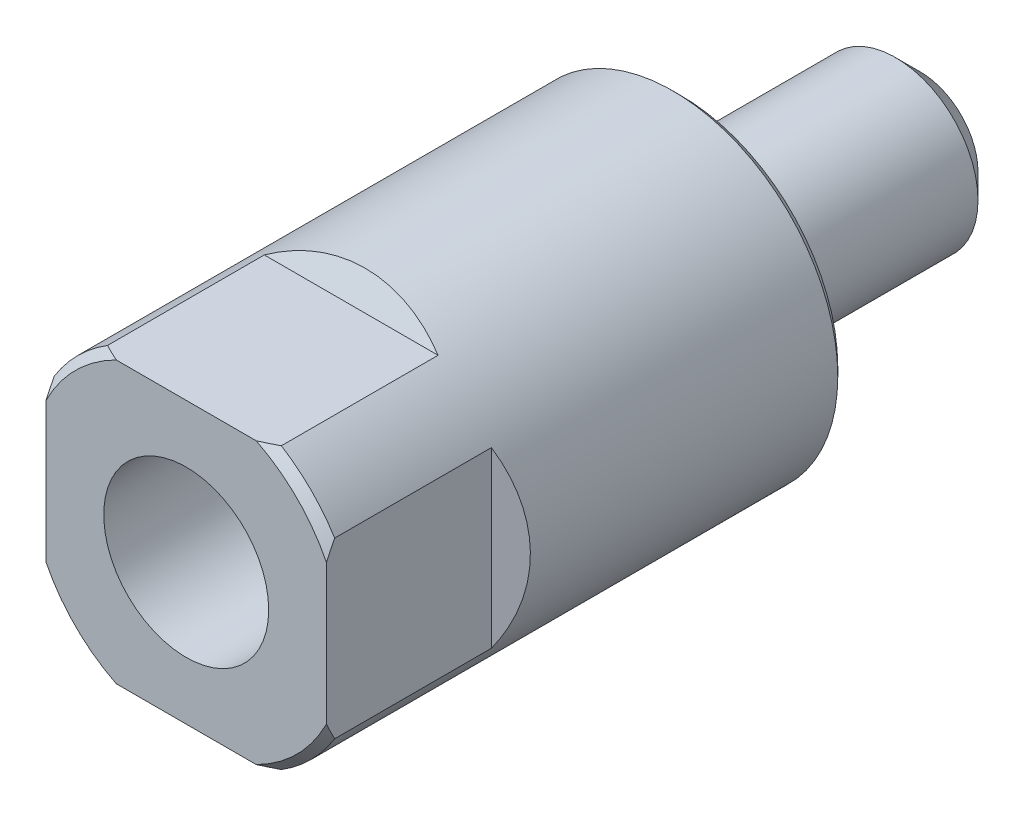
ISO-10303-21;
HEADER;
FILE_DESCRIPTION(('STEP AP214'),'2;1');
FILE_NAME('part.step','',(''),(''),'','','');
FILE_SCHEMA(('AUTOMOTIVE_DESIGN { 1 0 10303 214 1 1 1 1 }'));
ENDSEC;
DATA;
#1=APPLICATION_CONTEXT('core data for automotive mechanical design processes');
#2=APPLICATION_PROTOCOL_DEFINITION('international standard','automotive_design',2000,#1);
#3=PRODUCT_CONTEXT('',#1,'mechanical');
#4=PRODUCT('Part','Part','',(#3));
#5=PRODUCT_RELATED_PRODUCT_CATEGORY('part','',(#4));
#6=PRODUCT_DEFINITION_FORMATION('','',#4);
#7=PRODUCT_DEFINITION_CONTEXT('part definition',#1,'design');
#8=PRODUCT_DEFINITION('design','',#6,#7);
#9=PRODUCT_DEFINITION_SHAPE('','',#8);
#10=(LENGTH_UNIT() NAMED_UNIT(*) SI_UNIT(.MILLI.,.METRE.));
#11=(NAMED_UNIT(*) PLANE_ANGLE_UNIT() SI_UNIT($,.RADIAN.));
#12=(NAMED_UNIT(*) SI_UNIT($,.STERADIAN.) SOLID_ANGLE_UNIT());
#13=UNCERTAINTY_MEASURE_WITH_UNIT(LENGTH_MEASURE(1.E-05),#10,'distance_accuracy_value','');
#14=(GEOMETRIC_REPRESENTATION_CONTEXT(3) GLOBAL_UNCERTAINTY_ASSIGNED_CONTEXT((#13)) GLOBAL_UNIT_ASSIGNED_CONTEXT((#10,
#11,#12)) REPRESENTATION_CONTEXT('',''));
#15=CARTESIAN_POINT('',(0.,0.,0.));
#16=DIRECTION('',(0.,0.,1.));
#17=DIRECTION('',(1.,0.,0.));
#18=AXIS2_PLACEMENT_3D('',#15,#16,#17);
#19=CARTESIAN_POINT('',(0.,0.,-14.5));
#20=DIRECTION('',(0.,0.,1.));
#21=DIRECTION('',(1.,0.,0.));
#22=AXIS2_PLACEMENT_3D('',#19,#20,#21);
#23=PLANE('',#22);
#24=CARTESIAN_POINT('',(0.,0.,-14.5));
#25=DIRECTION('',(0.,0.,1.));
#26=DIRECTION('',(1.,0.,0.));
#27=AXIS2_PLACEMENT_3D('',#24,#25,#26);
#28=CIRCLE('',#27,3.5);
#29=CARTESIAN_POINT('',(3.5,0.,-14.5));
#30=VERTEX_POINT('',#29);
#31=EDGE_CURVE('E139',#30,#30,#28,.F.);
#32=ORIENTED_EDGE('',*,*,#31,.T.);
#33=EDGE_LOOP('',(#32));
#34=FACE_BOUND('',#33,.T.);
#35=ADVANCED_FACE('F14',(#34),#23,.F.);
#36=CARTESIAN_POINT('',(0.,0.,5.5));
#37=DIRECTION('',(0.,0.,1.));
#38=DIRECTION('',(1.,0.,0.));
#39=AXIS2_PLACEMENT_3D('',#36,#37,#38);
#40=CYLINDRICAL_SURFACE('',#39,5.);
#41=CARTESIAN_POINT('',(0.,0.,-13.));
#42=DIRECTION('',(0.,0.,1.));
#43=DIRECTION('',(1.,0.,0.));
#44=AXIS2_PLACEMENT_3D('',#41,#42,#43);
#45=CIRCLE('',#44,5.);
#46=CARTESIAN_POINT('',(5.,0.,-13.));
#47=VERTEX_POINT('',#46);
#48=EDGE_CURVE('E176',#47,#47,#45,.T.);
#49=ORIENTED_EDGE('',*,*,#48,.T.);
#50=EDGE_LOOP('',(#49));
#51=FACE_BOUND('',#50,.T.);
#52=CARTESIAN_POINT('',(0.,0.,0.));
#53=DIRECTION('',(0.,0.,1.));
#54=DIRECTION('',(1.,0.,0.));
#55=AXIS2_PLACEMENT_3D('',#52,#53,#54);
#56=CIRCLE('',#55,5.);
#57=CARTESIAN_POINT('',(5.,0.,0.));
#58=VERTEX_POINT('',#57);
#59=EDGE_CURVE('E136',#58,#58,#56,.T.);
#60=ORIENTED_EDGE('',*,*,#59,.F.);
#61=EDGE_LOOP('',(#60));
#62=FACE_BOUND('',#61,.T.);
#63=ADVANCED_FACE('F239',(#51,#62),#40,.T.);
#64=CARTESIAN_POINT('',(5.,0.,10.5));
#65=DIRECTION('',(0.,0.,-1.));
#66=DIRECTION('',(-1.,0.,0.));
#67=AXIS2_PLACEMENT_3D('',#64,#65,#66);
#68=PLANE('',#67);
#69=CARTESIAN_POINT('',(0.,0.,10.5));
#70=DIRECTION('',(0.,0.,1.));
#71=DIRECTION('',(1.,0.,0.));
#72=AXIS2_PLACEMENT_3D('',#69,#70,#71);
#73=CIRCLE('',#72,5.);
#74=CARTESIAN_POINT('',(5.,0.,10.5));
#75=VERTEX_POINT('',#74);
#76=EDGE_CURVE('E122',#75,#75,#73,.T.);
#77=ORIENTED_EDGE('',*,*,#76,.T.);
#78=EDGE_LOOP('',(#77));
#79=FACE_BOUND('',#78,.T.);
#80=ADVANCED_FACE('F223',(#79),#68,.F.);
#81=CARTESIAN_POINT('',(8.5,-10.,20.));
#82=DIRECTION('',(-0.5,0.,-0.866025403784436));
#83=DIRECTION('',(-0.866025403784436,0.,0.5));
#84=AXIS2_PLACEMENT_3D('',#81,#82,#83);
#85=PLANE('',#84);
#86=CARTESIAN_POINT('',(0.,0.,24.9074772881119));
#87=DIRECTION('',(-0.5,0.,-0.866025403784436));
#88=DIRECTION('',(0.866025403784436,0.,-0.5));
#89=AXIS2_PLACEMENT_3D('',#86,#87,#88);
#90=ELLIPSE('',#89,11.5470053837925,10.);
#91=CARTESIAN_POINT('',(8.5,5.26782687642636,20.));
#92=VERTEX_POINT('',#91);
#93=CARTESIAN_POINT('',(8.5,-5.26782687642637,20.));
#94=VERTEX_POINT('',#93);
#95=EDGE_CURVE('E159',#92,#94,#90,.T.);
#96=ORIENTED_EDGE('',*,*,#95,.F.);
#97=DIRECTION('',(0.,1.,0.));
#98=VECTOR('',#97,1.);
#99=CARTESIAN_POINT('',(8.5,-10.,20.));
#100=LINE('',#99,#98);
#101=EDGE_CURVE('E149',#94,#92,#100,.T.);
#102=ORIENTED_EDGE('',*,*,#101,.F.);
#103=EDGE_LOOP('',(#96,#102));
#104=FACE_BOUND('',#103,.T.);
#105=ADVANCED_FACE('F214',(#104),#85,.F.);
#106=CARTESIAN_POINT('',(8.5,-10.,30.));
#107=DIRECTION('',(-1.,0.,0.));
#108=DIRECTION('',(0.,0.,1.));
#109=AXIS2_PLACEMENT_3D('',#106,#107,#108);
#110=PLANE('',#109);
#111=DIRECTION('',(0.,-1.,0.));
#112=VECTOR('',#111,1.);
#113=CARTESIAN_POINT('',(8.5,0.,30.));
#114=LINE('',#113,#112);
#115=CARTESIAN_POINT('',(8.5,4.24264068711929,30.));
#116=VERTEX_POINT('',#115);
#117=CARTESIAN_POINT('',(8.5,-4.24264068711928,30.));
#118=VERTEX_POINT('',#117);
#119=EDGE_CURVE('E156',#116,#118,#114,.T.);
#120=ORIENTED_EDGE('',*,*,#119,.T.);
#121=CARTESIAN_POINT('',(8.5,-4.24264068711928,30.));
#122=CARTESIAN_POINT('',(8.5,-4.32945860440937,29.9612267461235));
#123=CARTESIAN_POINT('',(8.5,-4.41592077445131,29.9216614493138));
#124=CARTESIAN_POINT('',(8.5,-4.58812912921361,29.8410592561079));
#125=CARTESIAN_POINT('',(8.5,-4.67387549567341,29.8000227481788));
#126=CARTESIAN_POINT('',(8.5,-4.84469140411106,29.7165710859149));
#127=CARTESIAN_POINT('',(8.5,-4.92976096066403,29.674155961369));
#128=CARTESIAN_POINT('',(8.5,-5.09926830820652,29.5880268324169));
#129=CARTESIAN_POINT('',(8.5,-5.18370592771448,29.5443124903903));
#130=CARTESIAN_POINT('',(8.5,-5.26782687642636,29.5));
#131=B_SPLINE_CURVE_WITH_KNOTS('',3,(#121,#122,#123,#124,#125,#126,#127,#128,#129,#130),
.UNSPECIFIED.,.F.,.F.,(4,2,2,2,4),(0.,0.28524142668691,0.570408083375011,0.855568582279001,
1.14080384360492),.UNSPECIFIED.);
#132=CARTESIAN_POINT('',(8.5,-5.26782687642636,29.5));
#133=VERTEX_POINT('',#132);
#134=EDGE_CURVE('E198',#118,#133,#131,.T.);
#135=ORIENTED_EDGE('',*,*,#134,.T.);
#136=DIRECTION('',(0.,0.,-1.));
#137=VECTOR('',#136,1.);
#138=CARTESIAN_POINT('',(8.5,-5.26782687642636,30.));
#139=LINE('',#138,#137);
#140=EDGE_CURVE('E152',#94,#133,#139,.F.);
#141=ORIENTED_EDGE('',*,*,#140,.F.);
#142=ORIENTED_EDGE('',*,*,#101,.T.);
#143=DIRECTION('',(0.,0.,-1.));
#144=VECTOR('',#143,1.);
#145=CARTESIAN_POINT('',(8.5,5.26782687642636,30.));
#146=LINE('',#145,#144);
#147=CARTESIAN_POINT('',(8.5,5.26782687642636,29.5));
#148=VERTEX_POINT('',#147);
#149=EDGE_CURVE('E154',#148,#92,#146,.T.);
#150=ORIENTED_EDGE('',*,*,#149,.F.);
#151=CARTESIAN_POINT('',(8.5,5.26782687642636,29.5));
#152=CARTESIAN_POINT('',(8.5,5.18370592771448,29.5443124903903));
#153=CARTESIAN_POINT('',(8.5,5.09926830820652,29.5880268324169));
#154=CARTESIAN_POINT('',(8.5,4.92976096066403,29.674155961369));
#155=CARTESIAN_POINT('',(8.5,4.84469140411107,29.7165710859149));
#156=CARTESIAN_POINT('',(8.5,4.67387549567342,29.8000227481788));
#157=CARTESIAN_POINT('',(8.5,4.58812912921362,29.8410592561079));
#158=CARTESIAN_POINT('',(8.5,4.41592077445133,29.9216614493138));
#159=CARTESIAN_POINT('',(8.5,4.32945860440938,29.9612267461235));
#160=CARTESIAN_POINT('',(8.5,4.24264068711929,30.));
#161=B_SPLINE_CURVE_WITH_KNOTS('',3,(#151,#152,#153,#154,#155,#156,#157,#158,#159,#160),
.UNSPECIFIED.,.F.,.F.,(4,2,2,2,4),(0.,0.285235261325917,0.570395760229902,0.855562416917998,
1.14080384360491),.UNSPECIFIED.);
#162=EDGE_CURVE('E191',#148,#116,#161,.T.);
#163=ORIENTED_EDGE('',*,*,#162,.T.);
#164=EDGE_LOOP('',(#120,#135,#141,#142,#150,#163));
#165=FACE_BOUND('',#164,.T.);
#166=ADVANCED_FACE('F208',(#165),#110,.F.);
#167=CARTESIAN_POINT('',(10.,8.5,20.));
#168=DIRECTION('',(0.,-0.5,-0.866025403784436));
#169=DIRECTION('',(0.,0.866025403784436,-0.5));
#170=AXIS2_PLACEMENT_3D('',#167,#168,#169);
#171=PLANE('',#170);
#172=CARTESIAN_POINT('',(0.,0.,24.9074772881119));
#173=DIRECTION('',(0.,-0.5,-0.866025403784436));
#174=DIRECTION('',(0.,0.866025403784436,-0.5));
#175=AXIS2_PLACEMENT_3D('',#172,#173,#174);
#176=ELLIPSE('',#175,11.5470053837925,10.);
#177=CARTESIAN_POINT('',(-5.26782687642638,8.5,20.));
#178=VERTEX_POINT('',#177);
#179=CARTESIAN_POINT('',(5.26782687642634,8.5,20.));
#180=VERTEX_POINT('',#179);
#181=EDGE_CURVE('E168',#178,#180,#176,.T.);
#182=ORIENTED_EDGE('',*,*,#181,.F.);
#183=DIRECTION('',(-1.,0.,0.));
#184=VECTOR('',#183,1.);
#185=CARTESIAN_POINT('',(10.,8.5,20.));
#186=LINE('',#185,#184);
#187=EDGE_CURVE('E115',#180,#178,#186,.T.);
#188=ORIENTED_EDGE('',*,*,#187,.F.);
#189=EDGE_LOOP('',(#182,#188));
#190=FACE_BOUND('',#189,.T.);
#191=ADVANCED_FACE('F213',(#190),#171,.F.);
#192=CARTESIAN_POINT('',(10.,8.5,30.));
#193=DIRECTION('',(0.,-1.,0.));
#194=DIRECTION('',(1.,0.,0.));
#195=AXIS2_PLACEMENT_3D('',#192,#193,#194);
#196=PLANE('',#195);
#197=DIRECTION('',(0.,0.,-1.));
#198=VECTOR('',#197,1.);
#199=CARTESIAN_POINT('',(-5.2678268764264,8.5,30.));
#200=LINE('',#199,#198);
#201=CARTESIAN_POINT('',(-5.2678268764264,8.5,29.5));
#202=VERTEX_POINT('',#201);
#203=EDGE_CURVE('E133',#202,#178,#200,.T.);
#204=ORIENTED_EDGE('',*,*,#203,.F.);
#205=CARTESIAN_POINT('',(-5.26782687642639,8.5,29.5));
#206=CARTESIAN_POINT('',(-5.18370592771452,8.49999999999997,29.5443124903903));
#207=CARTESIAN_POINT('',(-5.09926830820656,8.49999999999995,29.588026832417));
#208=CARTESIAN_POINT('',(-4.92976096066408,8.49999999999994,29.674155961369));
#209=CARTESIAN_POINT('',(-4.84469140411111,8.49999999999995,29.7165710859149));
#210=CARTESIAN_POINT('',(-4.67387549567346,8.49999999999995,29.8000227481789));
#211=CARTESIAN_POINT('',(-4.58812912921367,8.49999999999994,29.8410592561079));
#212=CARTESIAN_POINT('',(-4.41592077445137,8.49999999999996,29.9216614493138));
#213=CARTESIAN_POINT('',(-4.32945860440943,8.49999999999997,29.9612267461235));
#214=CARTESIAN_POINT('',(-4.24264068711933,8.5,30.));
#215=B_SPLINE_CURVE_WITH_KNOTS('',3,(#205,#206,#207,#208,#209,#210,#211,#212,#213,#214),
.UNSPECIFIED.,.F.,.F.,(4,2,2,2,4),(0.,0.285235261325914,0.570395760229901,0.855562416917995,
1.1408038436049),.UNSPECIFIED.);
#216=CARTESIAN_POINT('',(-4.24264068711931,8.5,30.));
#217=VERTEX_POINT('',#216);
#218=EDGE_CURVE('E22',#202,#217,#215,.T.);
#219=ORIENTED_EDGE('',*,*,#218,.T.);
#220=DIRECTION('',(1.,0.,0.));
#221=VECTOR('',#220,1.);
#222=CARTESIAN_POINT('',(0.,8.5,30.));
#223=LINE('',#222,#221);
#224=CARTESIAN_POINT('',(4.24264068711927,8.5,30.));
#225=VERTEX_POINT('',#224);
#226=EDGE_CURVE('E166',#217,#225,#223,.T.);
#227=ORIENTED_EDGE('',*,*,#226,.T.);
#228=CARTESIAN_POINT('',(4.24264068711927,8.5,30.));
#229=CARTESIAN_POINT('',(4.32945860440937,8.49999999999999,29.9612267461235));
#230=CARTESIAN_POINT('',(4.41592077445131,8.49999999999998,29.9216614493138));
#231=CARTESIAN_POINT('',(4.58812912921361,8.49999999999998,29.8410592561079));
#232=CARTESIAN_POINT('',(4.67387549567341,8.49999999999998,29.8000227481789));
#233=CARTESIAN_POINT('',(4.84469140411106,8.49999999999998,29.7165710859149));
#234=CARTESIAN_POINT('',(4.92976096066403,8.49999999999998,29.674155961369));
#235=CARTESIAN_POINT('',(5.09926830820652,8.49999999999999,29.5880268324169));
#236=CARTESIAN_POINT('',(5.18370592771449,8.49999999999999,29.5443124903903));
#237=CARTESIAN_POINT('',(5.26782687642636,8.5,29.5));
#238=B_SPLINE_CURVE_WITH_KNOTS('',3,(#228,#229,#230,#231,#232,#233,#234,#235,#236,#237),
.UNSPECIFIED.,.F.,.F.,(4,2,2,2,4),(0.,0.285241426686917,0.570408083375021,0.855568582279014,
1.14080384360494),.UNSPECIFIED.);
#239=CARTESIAN_POINT('',(5.26782687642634,8.5,29.5));
#240=VERTEX_POINT('',#239);
#241=EDGE_CURVE('E29',#225,#240,#238,.T.);
#242=ORIENTED_EDGE('',*,*,#241,.T.);
#243=DIRECTION('',(0.,0.,-1.));
#244=VECTOR('',#243,1.);
#245=CARTESIAN_POINT('',(5.26782687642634,8.5,30.));
#246=LINE('',#245,#244);
#247=EDGE_CURVE('E131',#180,#240,#246,.F.);
#248=ORIENTED_EDGE('',*,*,#247,.F.);
#249=ORIENTED_EDGE('',*,*,#187,.T.);
#250=EDGE_LOOP('',(#204,#219,#227,#242,#248,#249));
#251=FACE_BOUND('',#250,.T.);
#252=ADVANCED_FACE('F283',(#251),#196,.F.);
#253=CARTESIAN_POINT('',(-8.5,-10.,20.));
#254=DIRECTION('',(0.5,0.,-0.866025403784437));
#255=DIRECTION('',(-0.866025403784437,0.,-0.5));
#256=AXIS2_PLACEMENT_3D('',#253,#254,#255);
#257=PLANE('',#256);
#258=CARTESIAN_POINT('',(0.,0.,24.9074772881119));
#259=DIRECTION('',(0.5,0.,-0.866025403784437));
#260=DIRECTION('',(-0.866025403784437,0.,-0.5));
#261=AXIS2_PLACEMENT_3D('',#258,#259,#260);
#262=ELLIPSE('',#261,11.5470053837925,10.);
#263=CARTESIAN_POINT('',(-8.5,-5.26782687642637,20.));
#264=VERTEX_POINT('',#263);
#265=CARTESIAN_POINT('',(-8.5,5.26782687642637,20.));
#266=VERTEX_POINT('',#265);
#267=EDGE_CURVE('E164',#264,#266,#262,.T.);
#268=ORIENTED_EDGE('',*,*,#267,.F.);
#269=DIRECTION('',(0.,1.,0.));
#270=VECTOR('',#269,1.);
#271=CARTESIAN_POINT('',(-8.5,-10.,20.));
#272=LINE('',#271,#270);
#273=EDGE_CURVE('E142',#264,#266,#272,.T.);
#274=ORIENTED_EDGE('',*,*,#273,.T.);
#275=EDGE_LOOP('',(#268,#274));
#276=FACE_BOUND('',#275,.T.);
#277=ADVANCED_FACE('F216',(#276),#257,.F.);
#278=CARTESIAN_POINT('',(-8.5,-10.,30.));
#279=DIRECTION('',(1.,0.,0.));
#280=DIRECTION('',(0.,0.,-1.));
#281=AXIS2_PLACEMENT_3D('',#278,#279,#280);
#282=PLANE('',#281);
#283=DIRECTION('',(0.,0.,-1.));
#284=VECTOR('',#283,1.);
#285=CARTESIAN_POINT('',(-8.5,-5.26782687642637,30.));
#286=LINE('',#285,#284);
#287=CARTESIAN_POINT('',(-8.5,-5.26782687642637,29.5));
#288=VERTEX_POINT('',#287);
#289=EDGE_CURVE('E147',#288,#264,#286,.T.);
#290=ORIENTED_EDGE('',*,*,#289,.F.);
#291=CARTESIAN_POINT('',(-8.5,-5.26782687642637,29.5));
#292=CARTESIAN_POINT('',(-8.5,-5.18370592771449,29.5443124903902));
#293=CARTESIAN_POINT('',(-8.5,-5.09926830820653,29.5880268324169));
#294=CARTESIAN_POINT('',(-8.5,-4.92976096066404,29.674155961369));
#295=CARTESIAN_POINT('',(-8.5,-4.84469140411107,29.7165710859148));
#296=CARTESIAN_POINT('',(-8.5,-4.67387549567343,29.8000227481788));
#297=CARTESIAN_POINT('',(-8.5,-4.58812912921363,29.8410592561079));
#298=CARTESIAN_POINT('',(-8.5,-4.41592077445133,29.9216614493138));
#299=CARTESIAN_POINT('',(-8.5,-4.32945860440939,29.9612267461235));
#300=CARTESIAN_POINT('',(-8.5,-4.24264068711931,30.));
#301=B_SPLINE_CURVE_WITH_KNOTS('',3,(#291,#292,#293,#294,#295,#296,#297,#298,#299,#300),
.UNSPECIFIED.,.F.,.F.,(4,2,2,2,4),(0.,0.285235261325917,0.570395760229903,0.855562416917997,
1.14080384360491),.UNSPECIFIED.);
#302=CARTESIAN_POINT('',(-8.5,-4.24264068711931,30.));
#303=VERTEX_POINT('',#302);
#304=EDGE_CURVE('E323',#288,#303,#301,.T.);
#305=ORIENTED_EDGE('',*,*,#304,.T.);
#306=DIRECTION('',(0.,1.,0.));
#307=VECTOR('',#306,1.);
#308=CARTESIAN_POINT('',(-8.5,0.,30.));
#309=LINE('',#308,#307);
#310=CARTESIAN_POINT('',(-8.5,4.24264068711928,30.));
#311=VERTEX_POINT('',#310);
#312=EDGE_CURVE('E161',#303,#311,#309,.T.);
#313=ORIENTED_EDGE('',*,*,#312,.T.);
#314=CARTESIAN_POINT('',(-8.5,4.24264068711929,30.));
#315=CARTESIAN_POINT('',(-8.5,4.32945860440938,29.9612267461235));
#316=CARTESIAN_POINT('',(-8.5,4.41592077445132,29.9216614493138));
#317=CARTESIAN_POINT('',(-8.5,4.58812912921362,29.8410592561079));
#318=CARTESIAN_POINT('',(-8.5,4.67387549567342,29.8000227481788));
#319=CARTESIAN_POINT('',(-8.5,4.84469140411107,29.7165710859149));
#320=CARTESIAN_POINT('',(-8.5,4.92976096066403,29.674155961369));
#321=CARTESIAN_POINT('',(-8.5,5.09926830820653,29.5880268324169));
#322=CARTESIAN_POINT('',(-8.5,5.18370592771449,29.5443124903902));
#323=CARTESIAN_POINT('',(-8.5,5.26782687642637,29.5));
#324=B_SPLINE_CURVE_WITH_KNOTS('',3,(#314,#315,#316,#317,#318,#319,#320,#321,#322,#323),
.UNSPECIFIED.,.F.,.F.,(4,2,2,2,4),(0.,0.285241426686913,0.570408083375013,0.855568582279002,
1.14080384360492),.UNSPECIFIED.);
#325=CARTESIAN_POINT('',(-8.5,5.26782687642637,29.5));
#326=VERTEX_POINT('',#325);
#327=EDGE_CURVE('E267',#311,#326,#324,.T.);
#328=ORIENTED_EDGE('',*,*,#327,.T.);
#329=DIRECTION('',(0.,0.,-1.));
#330=VECTOR('',#329,1.);
#331=CARTESIAN_POINT('',(-8.5,5.26782687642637,30.));
#332=LINE('',#331,#330);
#333=EDGE_CURVE('E145',#266,#326,#332,.F.);
#334=ORIENTED_EDGE('',*,*,#333,.F.);
#335=ORIENTED_EDGE('',*,*,#273,.F.);
#336=EDGE_LOOP('',(#290,#305,#313,#328,#334,#335));
#337=FACE_BOUND('',#336,.T.);
#338=ADVANCED_FACE('F217',(#337),#282,.F.);
#339=CARTESIAN_POINT('',(10.,-8.5,20.));
#340=DIRECTION('',(0.,0.5,-0.866025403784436));
#341=DIRECTION('',(0.,0.866025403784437,0.5));
#342=AXIS2_PLACEMENT_3D('',#339,#340,#341);
#343=PLANE('',#342);
#344=CARTESIAN_POINT('',(0.,0.,24.9074772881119));
#345=DIRECTION('',(0.,0.5,-0.866025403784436));
#346=DIRECTION('',(0.,-0.866025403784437,-0.5));
#347=AXIS2_PLACEMENT_3D('',#344,#345,#346);
#348=ELLIPSE('',#347,11.5470053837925,10.);
#349=CARTESIAN_POINT('',(5.26782687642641,-8.5,20.));
#350=VERTEX_POINT('',#349);
#351=CARTESIAN_POINT('',(-5.26782687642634,-8.5,20.));
#352=VERTEX_POINT('',#351);
#353=EDGE_CURVE('E108',#350,#352,#348,.T.);
#354=ORIENTED_EDGE('',*,*,#353,.F.);
#355=DIRECTION('',(-1.,0.,0.));
#356=VECTOR('',#355,1.);
#357=CARTESIAN_POINT('',(10.,-8.5,20.));
#358=LINE('',#357,#356);
#359=EDGE_CURVE('E121',#350,#352,#358,.T.);
#360=ORIENTED_EDGE('',*,*,#359,.T.);
#361=EDGE_LOOP('',(#354,#360));
#362=FACE_BOUND('',#361,.T.);
#363=ADVANCED_FACE('F120',(#362),#343,.F.);
#364=CARTESIAN_POINT('',(10.,-8.5,30.));
#365=DIRECTION('',(0.,1.,0.));
#366=DIRECTION('',(-1.,0.,0.));
#367=AXIS2_PLACEMENT_3D('',#364,#365,#366);
#368=PLANE('',#367);
#369=DIRECTION('',(0.,0.,-1.));
#370=VECTOR('',#369,1.);
#371=CARTESIAN_POINT('',(5.26782687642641,-8.5,30.));
#372=LINE('',#371,#370);
#373=CARTESIAN_POINT('',(5.26782687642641,-8.5,29.5));
#374=VERTEX_POINT('',#373);
#375=EDGE_CURVE('E103',#374,#350,#372,.T.);
#376=ORIENTED_EDGE('',*,*,#375,.F.);
#377=CARTESIAN_POINT('',(5.2678268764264,-8.5,29.5));
#378=CARTESIAN_POINT('',(5.18370592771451,-8.50000000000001,29.5443124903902));
#379=CARTESIAN_POINT('',(5.09926830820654,-8.50000000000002,29.5880268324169));
#380=CARTESIAN_POINT('',(4.92976096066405,-8.50000000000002,29.674155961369));
#381=CARTESIAN_POINT('',(4.84469140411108,-8.50000000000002,29.7165710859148));
#382=CARTESIAN_POINT('',(4.67387549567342,-8.50000000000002,29.8000227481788));
#383=CARTESIAN_POINT('',(4.58812912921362,-8.50000000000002,29.8410592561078));
#384=CARTESIAN_POINT('',(4.41592077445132,-8.50000000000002,29.9216614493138));
#385=CARTESIAN_POINT('',(4.32945860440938,-8.50000000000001,29.9612267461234));
#386=CARTESIAN_POINT('',(4.24264068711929,-8.5,30.));
#387=B_SPLINE_CURVE_WITH_KNOTS('',3,(#377,#378,#379,#380,#381,#382,#383,#384,#385,#386),
.UNSPECIFIED.,.F.,.F.,(4,2,2,2,4),(0.,0.285235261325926,0.570395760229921,0.855562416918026,
1.14080384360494),.UNSPECIFIED.);
#388=CARTESIAN_POINT('',(4.24264068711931,-8.5,30.));
#389=VERTEX_POINT('',#388);
#390=EDGE_CURVE('E259',#374,#389,#387,.T.);
#391=ORIENTED_EDGE('',*,*,#390,.T.);
#392=DIRECTION('',(-1.,0.,0.));
#393=VECTOR('',#392,1.);
#394=CARTESIAN_POINT('',(0.,-8.5,30.));
#395=LINE('',#394,#393);
#396=CARTESIAN_POINT('',(-4.24264068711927,-8.5,30.));
#397=VERTEX_POINT('',#396);
#398=EDGE_CURVE('E123',#389,#397,#395,.T.);
#399=ORIENTED_EDGE('',*,*,#398,.T.);
#400=CARTESIAN_POINT('',(-4.24264068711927,-8.5,30.));
#401=CARTESIAN_POINT('',(-4.32945860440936,-8.50000000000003,29.9612267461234));
#402=CARTESIAN_POINT('',(-4.41592077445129,-8.50000000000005,29.9216614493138));
#403=CARTESIAN_POINT('',(-4.58812912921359,-8.50000000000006,29.8410592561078));
#404=CARTESIAN_POINT('',(-4.67387549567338,-8.50000000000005,29.8000227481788));
#405=CARTESIAN_POINT('',(-4.84469140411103,-8.50000000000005,29.7165710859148));
#406=CARTESIAN_POINT('',(-4.929760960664,-8.50000000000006,29.674155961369));
#407=CARTESIAN_POINT('',(-5.09926830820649,-8.50000000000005,29.5880268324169));
#408=CARTESIAN_POINT('',(-5.18370592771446,-8.50000000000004,29.5443124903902));
#409=CARTESIAN_POINT('',(-5.26782687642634,-8.5,29.5));
#410=B_SPLINE_CURVE_WITH_KNOTS('',3,(#400,#401,#402,#403,#404,#405,#406,#407,#408,#409),
.UNSPECIFIED.,.F.,.F.,(4,2,2,2,4),(0.,0.285241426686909,0.570408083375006,0.85556858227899,
1.14080384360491),.UNSPECIFIED.);
#411=CARTESIAN_POINT('',(-5.26782687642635,-8.5,29.5));
#412=VERTEX_POINT('',#411);
#413=EDGE_CURVE('E268',#397,#412,#410,.T.);
#414=ORIENTED_EDGE('',*,*,#413,.T.);
#415=DIRECTION('',(0.,0.,-1.));
#416=VECTOR('',#415,1.);
#417=CARTESIAN_POINT('',(-5.26782687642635,-8.5,30.));
#418=LINE('',#417,#416);
#419=EDGE_CURVE('E116',#352,#412,#418,.F.);
#420=ORIENTED_EDGE('',*,*,#419,.F.);
#421=ORIENTED_EDGE('',*,*,#359,.F.);
#422=EDGE_LOOP('',(#376,#391,#399,#414,#420,#421));
#423=FACE_BOUND('',#422,.T.);
#424=ADVANCED_FACE('F125',(#423),#368,.F.);
#425=CARTESIAN_POINT('',(0.,0.,30.));
#426=DIRECTION('',(0.,0.,-1.));
#427=DIRECTION('',(-1.,0.,0.));
#428=AXIS2_PLACEMENT_3D('',#425,#426,#427);
#429=CYLINDRICAL_SURFACE('',#428,10.);
#430=CARTESIAN_POINT('',(0.,0.,0.499999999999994));
#431=DIRECTION('',(0.,0.,1.));
#432=DIRECTION('',(1.,0.,0.));
#433=AXIS2_PLACEMENT_3D('',#430,#431,#432);
#434=CIRCLE('',#433,10.);
#435=CARTESIAN_POINT('',(10.,0.,0.499999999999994));
#436=VERTEX_POINT('',#435);
#437=EDGE_CURVE('E343',#436,#436,#434,.T.);
#438=ORIENTED_EDGE('',*,*,#437,.T.);
#439=EDGE_LOOP('',(#438));
#440=FACE_BOUND('',#439,.T.);
#441=ORIENTED_EDGE('',*,*,#140,.T.);
#442=CARTESIAN_POINT('',(0.,0.,29.5));
#443=DIRECTION('',(0.,0.,1.));
#444=DIRECTION('',(1.,0.,0.));
#445=AXIS2_PLACEMENT_3D('',#442,#443,#444);
#446=CIRCLE('',#445,10.);
#447=EDGE_CURVE('E111',#133,#374,#446,.F.);
#448=ORIENTED_EDGE('',*,*,#447,.T.);
#449=ORIENTED_EDGE('',*,*,#375,.T.);
#450=ORIENTED_EDGE('',*,*,#353,.T.);
#451=ORIENTED_EDGE('',*,*,#419,.T.);
#452=CARTESIAN_POINT('',(0.,0.,29.5));
#453=DIRECTION('',(0.,0.,1.));
#454=DIRECTION('',(1.,0.,0.));
#455=AXIS2_PLACEMENT_3D('',#452,#453,#454);
#456=CIRCLE('',#455,10.);
#457=EDGE_CURVE('E337',#412,#288,#456,.F.);
#458=ORIENTED_EDGE('',*,*,#457,.T.);
#459=ORIENTED_EDGE('',*,*,#289,.T.);
#460=ORIENTED_EDGE('',*,*,#267,.T.);
#461=ORIENTED_EDGE('',*,*,#333,.T.);
#462=CARTESIAN_POINT('',(0.,0.,29.5));
#463=DIRECTION('',(0.,0.,1.));
#464=DIRECTION('',(1.,0.,0.));
#465=AXIS2_PLACEMENT_3D('',#462,#463,#464);
#466=CIRCLE('',#465,10.);
#467=EDGE_CURVE('E37',#326,#202,#466,.F.);
#468=ORIENTED_EDGE('',*,*,#467,.T.);
#469=ORIENTED_EDGE('',*,*,#203,.T.);
#470=ORIENTED_EDGE('',*,*,#181,.T.);
#471=ORIENTED_EDGE('',*,*,#247,.T.);
#472=CARTESIAN_POINT('',(0.,0.,29.5));
#473=DIRECTION('',(0.,0.,1.));
#474=DIRECTION('',(1.,0.,0.));
#475=AXIS2_PLACEMENT_3D('',#472,#473,#474);
#476=CIRCLE('',#475,10.);
#477=EDGE_CURVE('E322',#240,#148,#476,.F.);
#478=ORIENTED_EDGE('',*,*,#477,.T.);
#479=ORIENTED_EDGE('',*,*,#149,.T.);
#480=ORIENTED_EDGE('',*,*,#95,.T.);
#481=EDGE_LOOP('',(#441,#448,#449,#450,#451,#458,#459,#460,#461,#468,#469,#470,#471,#478,#479,#480));
#482=FACE_BOUND('',#481,.T.);
#483=ADVANCED_FACE('F106',(#440,#482),#429,.T.);
#484=CARTESIAN_POINT('',(0.,0.,0.));
#485=DIRECTION('',(0.,0.,1.));
#486=DIRECTION('',(1.,0.,0.));
#487=AXIS2_PLACEMENT_3D('',#484,#485,#486);
#488=PLANE('',#487);
#489=CARTESIAN_POINT('',(0.,0.,0.));
#490=DIRECTION('',(0.,0.,1.));
#491=DIRECTION('',(1.,0.,0.));
#492=AXIS2_PLACEMENT_3D('',#489,#490,#491);
#493=CIRCLE('',#492,9.5);
#494=CARTESIAN_POINT('',(9.5,0.,0.));
#495=VERTEX_POINT('',#494);
#496=EDGE_CURVE('E9',#495,#495,#493,.F.);
#497=ORIENTED_EDGE('',*,*,#496,.T.);
#498=EDGE_LOOP('',(#497));
#499=FACE_BOUND('',#498,.T.);
#500=ORIENTED_EDGE('',*,*,#59,.T.);
#501=EDGE_LOOP('',(#500));
#502=FACE_BOUND('',#501,.T.);
#503=ADVANCED_FACE('F225',(#499,#502),#488,.F.);
#504=CARTESIAN_POINT('',(0.,0.,30.));
#505=DIRECTION('',(0.,0.,1.));
#506=DIRECTION('',(1.,0.,0.));
#507=AXIS2_PLACEMENT_3D('',#504,#505,#506);
#508=PLANE('',#507);
#509=ORIENTED_EDGE('',*,*,#398,.F.);
#510=CARTESIAN_POINT('',(0.,0.,30.));
#511=DIRECTION('',(0.,0.,1.));
#512=DIRECTION('',(1.,0.,0.));
#513=AXIS2_PLACEMENT_3D('',#510,#511,#512);
#514=CIRCLE('',#513,9.5);
#515=EDGE_CURVE('E188',#389,#118,#514,.T.);
#516=ORIENTED_EDGE('',*,*,#515,.T.);
#517=ORIENTED_EDGE('',*,*,#119,.F.);
#518=CARTESIAN_POINT('',(0.,0.,30.));
#519=DIRECTION('',(0.,0.,1.));
#520=DIRECTION('',(1.,0.,0.));
#521=AXIS2_PLACEMENT_3D('',#518,#519,#520);
#522=CIRCLE('',#521,9.5);
#523=EDGE_CURVE('E179',#116,#225,#522,.T.);
#524=ORIENTED_EDGE('',*,*,#523,.T.);
#525=ORIENTED_EDGE('',*,*,#226,.F.);
#526=CARTESIAN_POINT('',(0.,0.,30.));
#527=DIRECTION('',(0.,0.,1.));
#528=DIRECTION('',(1.,0.,0.));
#529=AXIS2_PLACEMENT_3D('',#526,#527,#528);
#530=CIRCLE('',#529,9.5);
#531=EDGE_CURVE('E182',#217,#311,#530,.T.);
#532=ORIENTED_EDGE('',*,*,#531,.T.);
#533=ORIENTED_EDGE('',*,*,#312,.F.);
#534=CARTESIAN_POINT('',(0.,0.,30.));
#535=DIRECTION('',(0.,0.,1.));
#536=DIRECTION('',(1.,0.,0.));
#537=AXIS2_PLACEMENT_3D('',#534,#535,#536);
#538=CIRCLE('',#537,9.5);
#539=EDGE_CURVE('E185',#303,#397,#538,.T.);
#540=ORIENTED_EDGE('',*,*,#539,.T.);
#541=EDGE_LOOP('',(#509,#516,#517,#524,#525,#532,#533,#540));
#542=FACE_BOUND('',#541,.T.);
#543=CARTESIAN_POINT('',(0.,0.,30.));
#544=DIRECTION('',(0.,0.,1.));
#545=DIRECTION('',(1.,0.,0.));
#546=AXIS2_PLACEMENT_3D('',#543,#544,#545);
#547=CIRCLE('',#546,5.);
#548=CARTESIAN_POINT('',(5.,0.,30.));
#549=VERTEX_POINT('',#548);
#550=EDGE_CURVE('E135',#549,#549,#547,.T.);
#551=ORIENTED_EDGE('',*,*,#550,.F.);
#552=EDGE_LOOP('',(#551));
#553=FACE_BOUND('',#552,.T.);
#554=ADVANCED_FACE('F228',(#542,#553),#508,.T.);
#555=CARTESIAN_POINT('',(0.,0.,30.));
#556=DIRECTION('',(0.,0.,1.));
#557=DIRECTION('',(1.,0.,0.));
#558=AXIS2_PLACEMENT_3D('',#555,#556,#557);
#559=CYLINDRICAL_SURFACE('',#558,5.);
#560=ORIENTED_EDGE('',*,*,#76,.F.);
#561=EDGE_LOOP('',(#560));
#562=FACE_BOUND('',#561,.T.);
#563=ORIENTED_EDGE('',*,*,#550,.T.);
#564=EDGE_LOOP('',(#563));
#565=FACE_BOUND('',#564,.T.);
#566=ADVANCED_FACE('F232',(#562,#565),#559,.F.);
#567=CARTESIAN_POINT('',(0.,0.,-14.5));
#568=DIRECTION('',(0.,0.,1.));
#569=DIRECTION('',(1.,0.,0.));
#570=AXIS2_PLACEMENT_3D('',#567,#568,#569);
#571=CONICAL_SURFACE('',#570,3.5,0.785398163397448);
#572=ORIENTED_EDGE('',*,*,#48,.F.);
#573=EDGE_LOOP('',(#572));
#574=FACE_BOUND('',#573,.T.);
#575=ORIENTED_EDGE('',*,*,#31,.F.);
#576=EDGE_LOOP('',(#575));
#577=FACE_BOUND('',#576,.T.);
#578=ADVANCED_FACE('F241',(#574,#577),#571,.T.);
#579=CARTESIAN_POINT('',(0.,0.,30.));
#580=DIRECTION('',(0.,0.,-1.));
#581=DIRECTION('',(-1.,0.,0.));
#582=AXIS2_PLACEMENT_3D('',#579,#580,#581);
#583=CONICAL_SURFACE('',#582,9.5,0.78539816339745);
#584=ORIENTED_EDGE('',*,*,#390,.F.);
#585=ORIENTED_EDGE('',*,*,#447,.F.);
#586=ORIENTED_EDGE('',*,*,#134,.F.);
#587=ORIENTED_EDGE('',*,*,#515,.F.);
#588=EDGE_LOOP('',(#584,#585,#586,#587));
#589=FACE_BOUND('',#588,.T.);
#590=ADVANCED_FACE('F249',(#589),#583,.T.);
#591=CARTESIAN_POINT('',(0.,0.,30.));
#592=DIRECTION('',(0.,0.,-1.));
#593=DIRECTION('',(-1.,0.,0.));
#594=AXIS2_PLACEMENT_3D('',#591,#592,#593);
#595=CONICAL_SURFACE('',#594,9.5,0.785398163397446);
#596=ORIENTED_EDGE('',*,*,#304,.F.);
#597=ORIENTED_EDGE('',*,*,#457,.F.);
#598=ORIENTED_EDGE('',*,*,#413,.F.);
#599=ORIENTED_EDGE('',*,*,#539,.F.);
#600=EDGE_LOOP('',(#596,#597,#598,#599));
#601=FACE_BOUND('',#600,.T.);
#602=ADVANCED_FACE('F254',(#601),#595,.T.);
#603=CARTESIAN_POINT('',(0.,0.,30.));
#604=DIRECTION('',(0.,0.,-1.));
#605=DIRECTION('',(-1.,0.,0.));
#606=AXIS2_PLACEMENT_3D('',#603,#604,#605);
#607=CONICAL_SURFACE('',#606,9.5,0.785398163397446);
#608=ORIENTED_EDGE('',*,*,#218,.F.);
#609=ORIENTED_EDGE('',*,*,#467,.F.);
#610=ORIENTED_EDGE('',*,*,#327,.F.);
#611=ORIENTED_EDGE('',*,*,#531,.F.);
#612=EDGE_LOOP('',(#608,#609,#610,#611));
#613=FACE_BOUND('',#612,.T.);
#614=ADVANCED_FACE('F299',(#613),#607,.T.);
#615=CARTESIAN_POINT('',(0.,0.,30.));
#616=DIRECTION('',(0.,0.,-1.));
#617=DIRECTION('',(-1.,0.,0.));
#618=AXIS2_PLACEMENT_3D('',#615,#616,#617);
#619=CONICAL_SURFACE('',#618,9.5,0.78539816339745);
#620=ORIENTED_EDGE('',*,*,#162,.F.);
#621=ORIENTED_EDGE('',*,*,#477,.F.);
#622=ORIENTED_EDGE('',*,*,#241,.F.);
#623=ORIENTED_EDGE('',*,*,#523,.F.);
#624=EDGE_LOOP('',(#620,#621,#622,#623));
#625=FACE_BOUND('',#624,.T.);
#626=ADVANCED_FACE('F205',(#625),#619,.T.);
#627=CARTESIAN_POINT('',(0.,0.,0.499999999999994));
#628=DIRECTION('',(0.,0.,1.));
#629=DIRECTION('',(1.,0.,0.));
#630=AXIS2_PLACEMENT_3D('',#627,#628,#629);
#631=CONICAL_SURFACE('',#630,10.,0.785398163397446);
#632=ORIENTED_EDGE('',*,*,#496,.F.);
#633=EDGE_LOOP('',(#632));
#634=FACE_BOUND('',#633,.T.);
#635=ORIENTED_EDGE('',*,*,#437,.F.);
#636=EDGE_LOOP('',(#635));
#637=FACE_BOUND('',#636,.T.);
#638=ADVANCED_FACE('F16',(#634,#637),#631,.T.);
#639=CLOSED_SHELL('',(#35,#63,#80,#105,#166,#191,#252,#277,#338,#363,#424,#483,#503,#554,#566,
#578,#590,#602,#614,#626,#638));
#640=MANIFOLD_SOLID_BREP('B1',#639);
#641=ADVANCED_BREP_SHAPE_REPRESENTATION('',(#18,#640),#14);
#642=SHAPE_DEFINITION_REPRESENTATION(#9,#641);
ENDSEC;
END-ISO-10303-21;
